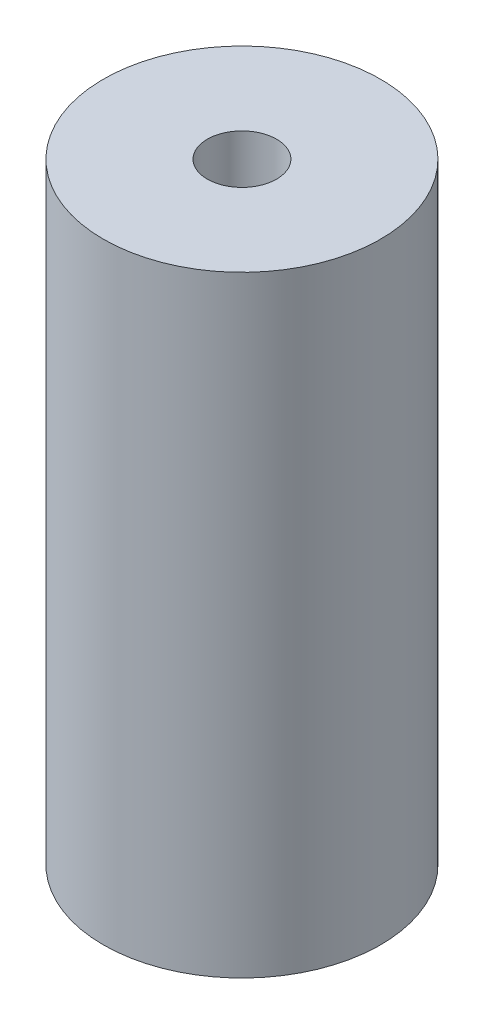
from build123d import *

# Parameters (mm, degrees)
SKETCH5_R                    = 6.35
BOSS_EXTRUDE1_DEPTH          = 14
F_1_8_0_125_DIAMETER_HOLE1_D = 3.175


with BuildPart() as part:
    # Sketch5 → Boss-Extrude1 (new, symmetric)
    with BuildSketch(Plane(origin=(0, 0, 0), x_dir=(1, 0, 0), z_dir=(0, 1, 0))):
        with Locations(Location((0, 0, 0), (0, 0, 270))):
            Circle(SKETCH5_R)
    extrude(amount=BOSS_EXTRUDE1_DEPTH, both=True)

    # 1_8 _0.125_ Diameter Hole1 (through all)
    with Locations(Plane(origin=(0, 14, 0), x_dir=(1, 0, 0), z_dir=(0, 1, 0))):
        with Locations((0, 0)):
            Hole(F_1_8_0_125_DIAMETER_HOLE1_D / 2)

    # Sketch13 → Cut-Revolve1 (revolve, cut)
    with BuildSketch(Plane(origin=(0, 0, 0), x_dir=(0, 0, -1), z_dir=(1, 0, 0))):
        Polygon((-1.5875, -11.6), (-3.9875, -14), (-1.5875, -14), align=None)
    revolve(axis=Axis((0, -50, 0), (0, 1, 0)), mode=Mode.SUBTRACT)


solid = part.part
